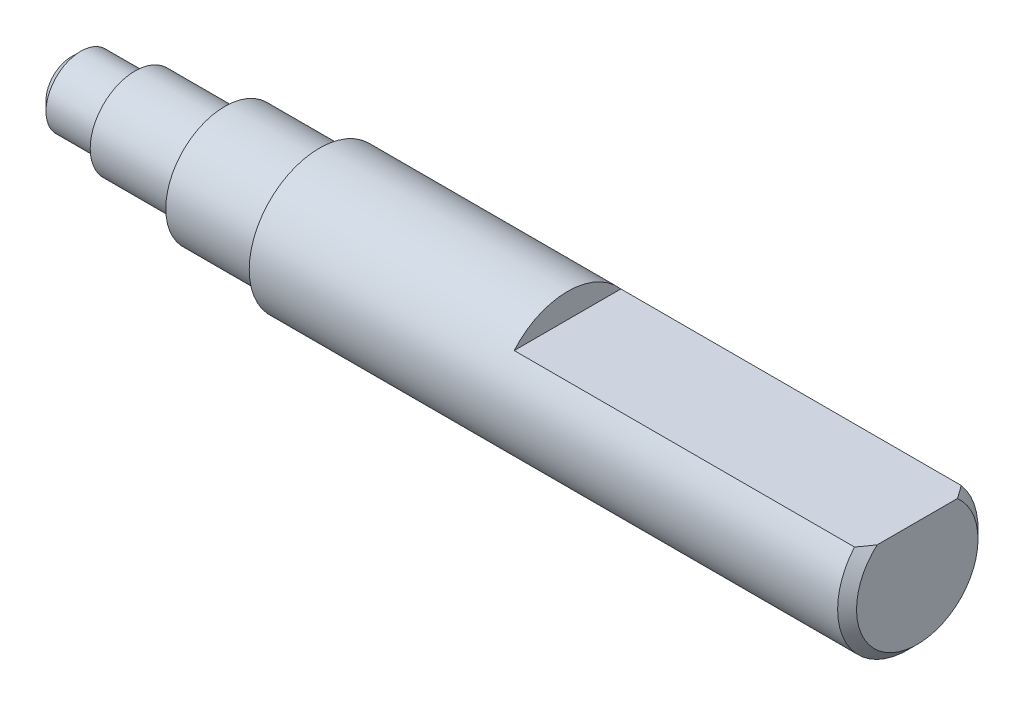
ISO-10303-21;
HEADER;
FILE_DESCRIPTION(('STEP AP214'),'2;1');
FILE_NAME('part.step','',(''),(''),'','','');
FILE_SCHEMA(('AUTOMOTIVE_DESIGN { 1 0 10303 214 1 1 1 1 }'));
ENDSEC;
DATA;
#1=APPLICATION_CONTEXT('core data for automotive mechanical design processes');
#2=APPLICATION_PROTOCOL_DEFINITION('international standard','automotive_design',2000,#1);
#3=PRODUCT_CONTEXT('',#1,'mechanical');
#4=PRODUCT('Part','Part','',(#3));
#5=PRODUCT_RELATED_PRODUCT_CATEGORY('part','',(#4));
#6=PRODUCT_DEFINITION_FORMATION('','',#4);
#7=PRODUCT_DEFINITION_CONTEXT('part definition',#1,'design');
#8=PRODUCT_DEFINITION('design','',#6,#7);
#9=PRODUCT_DEFINITION_SHAPE('','',#8);
#10=(LENGTH_UNIT() NAMED_UNIT(*) SI_UNIT(.MILLI.,.METRE.));
#11=(NAMED_UNIT(*) PLANE_ANGLE_UNIT() SI_UNIT($,.RADIAN.));
#12=(NAMED_UNIT(*) SI_UNIT($,.STERADIAN.) SOLID_ANGLE_UNIT());
#13=UNCERTAINTY_MEASURE_WITH_UNIT(LENGTH_MEASURE(1.E-05),#10,'distance_accuracy_value','');
#14=(GEOMETRIC_REPRESENTATION_CONTEXT(3) GLOBAL_UNCERTAINTY_ASSIGNED_CONTEXT((#13)) GLOBAL_UNIT_ASSIGNED_CONTEXT((#10,
#11,#12)) REPRESENTATION_CONTEXT('',''));
#15=CARTESIAN_POINT('',(0.,0.,0.));
#16=DIRECTION('',(0.,0.,1.));
#17=DIRECTION('',(1.,0.,0.));
#18=AXIS2_PLACEMENT_3D('',#15,#16,#17);
#19=CARTESIAN_POINT('',(0.,0.,0.));
#20=DIRECTION('',(1.,0.,0.));
#21=DIRECTION('',(0.,0.,-1.));
#22=AXIS2_PLACEMENT_3D('',#19,#20,#21);
#23=PLANE('',#22);
#24=CARTESIAN_POINT('',(0.,0.,0.));
#25=DIRECTION('',(1.,0.,0.));
#26=DIRECTION('',(0.,0.,-1.));
#27=AXIS2_PLACEMENT_3D('',#24,#25,#26);
#28=CIRCLE('',#27,0.535000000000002);
#29=CARTESIAN_POINT('',(0.,0.,-0.535000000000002));
#30=VERTEX_POINT('',#29);
#31=EDGE_CURVE('E126',#30,#30,#28,.F.);
#32=ORIENTED_EDGE('',*,*,#31,.T.);
#33=EDGE_LOOP('',(#32));
#34=FACE_BOUND('',#33,.T.);
#35=ADVANCED_FACE('F41',(#34),#23,.F.);
#36=CARTESIAN_POINT('',(-168.144085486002,0.,0.));
#37=DIRECTION('',(-1.,0.,0.));
#38=DIRECTION('',(0.,0.,1.));
#39=AXIS2_PLACEMENT_3D('',#36,#37,#38);
#40=CYLINDRICAL_SURFACE('',#39,0.735);
#41=CARTESIAN_POINT('',(0.200000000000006,0.,0.));
#42=DIRECTION('',(1.,0.,0.));
#43=DIRECTION('',(0.,0.,-1.));
#44=AXIS2_PLACEMENT_3D('',#41,#42,#43);
#45=CIRCLE('',#44,0.735);
#46=CARTESIAN_POINT('',(0.200000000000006,0.,-0.735));
#47=VERTEX_POINT('',#46);
#48=EDGE_CURVE('E130',#47,#47,#45,.T.);
#49=ORIENTED_EDGE('',*,*,#48,.T.);
#50=EDGE_LOOP('',(#49));
#51=FACE_BOUND('',#50,.T.);
#52=CARTESIAN_POINT('',(1.34999999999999,0.,0.));
#53=DIRECTION('',(-1.,0.,0.));
#54=DIRECTION('',(0.,0.,1.));
#55=AXIS2_PLACEMENT_3D('',#52,#53,#54);
#56=CIRCLE('',#55,0.735);
#57=CARTESIAN_POINT('',(1.34999999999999,0.,0.735));
#58=VERTEX_POINT('',#57);
#59=EDGE_CURVE('E122',#58,#58,#56,.T.);
#60=ORIENTED_EDGE('',*,*,#59,.T.);
#61=EDGE_LOOP('',(#60));
#62=FACE_BOUND('',#61,.T.);
#63=ADVANCED_FACE('F176',(#51,#62),#40,.T.);
#64=CARTESIAN_POINT('',(1.35,0.735,0.));
#65=DIRECTION('',(1.,0.,0.));
#66=DIRECTION('',(0.,0.,-1.));
#67=AXIS2_PLACEMENT_3D('',#64,#65,#66);
#68=PLANE('',#67);
#69=ORIENTED_EDGE('',*,*,#59,.F.);
#70=EDGE_LOOP('',(#69));
#71=FACE_BOUND('',#70,.T.);
#72=CARTESIAN_POINT('',(1.34999999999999,0.,0.));
#73=DIRECTION('',(-1.,0.,0.));
#74=DIRECTION('',(0.,0.,1.));
#75=AXIS2_PLACEMENT_3D('',#72,#73,#74);
#76=CIRCLE('',#75,0.95);
#77=CARTESIAN_POINT('',(1.34999999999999,0.,0.95));
#78=VERTEX_POINT('',#77);
#79=EDGE_CURVE('E118',#78,#78,#76,.T.);
#80=ORIENTED_EDGE('',*,*,#79,.T.);
#81=EDGE_LOOP('',(#80));
#82=FACE_BOUND('',#81,.T.);
#83=ADVANCED_FACE('F172',(#71,#82),#68,.F.);
#84=CARTESIAN_POINT('',(-168.144085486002,0.,0.));
#85=DIRECTION('',(-1.,0.,0.));
#86=DIRECTION('',(0.,0.,1.));
#87=AXIS2_PLACEMENT_3D('',#84,#85,#86);
#88=CYLINDRICAL_SURFACE('',#87,0.95);
#89=ORIENTED_EDGE('',*,*,#79,.F.);
#90=EDGE_LOOP('',(#89));
#91=FACE_BOUND('',#90,.T.);
#92=CARTESIAN_POINT('',(3.25,0.,0.));
#93=DIRECTION('',(-1.,0.,0.));
#94=DIRECTION('',(0.,0.,1.));
#95=AXIS2_PLACEMENT_3D('',#92,#93,#94);
#96=CIRCLE('',#95,0.95);
#97=CARTESIAN_POINT('',(3.25,0.,0.95));
#98=VERTEX_POINT('',#97);
#99=EDGE_CURVE('E114',#98,#98,#96,.T.);
#100=ORIENTED_EDGE('',*,*,#99,.T.);
#101=EDGE_LOOP('',(#100));
#102=FACE_BOUND('',#101,.T.);
#103=ADVANCED_FACE('F168',(#91,#102),#88,.T.);
#104=CARTESIAN_POINT('',(3.25,0.95,0.));
#105=DIRECTION('',(1.,0.,0.));
#106=DIRECTION('',(0.,0.,-1.));
#107=AXIS2_PLACEMENT_3D('',#104,#105,#106);
#108=PLANE('',#107);
#109=ORIENTED_EDGE('',*,*,#99,.F.);
#110=EDGE_LOOP('',(#109));
#111=FACE_BOUND('',#110,.T.);
#112=CARTESIAN_POINT('',(3.25,0.,0.));
#113=DIRECTION('',(-1.,0.,0.));
#114=DIRECTION('',(0.,0.,1.));
#115=AXIS2_PLACEMENT_3D('',#112,#113,#114);
#116=CIRCLE('',#115,1.25);
#117=CARTESIAN_POINT('',(3.25,0.,1.25));
#118=VERTEX_POINT('',#117);
#119=EDGE_CURVE('E110',#118,#118,#116,.T.);
#120=ORIENTED_EDGE('',*,*,#119,.T.);
#121=EDGE_LOOP('',(#120));
#122=FACE_BOUND('',#121,.T.);
#123=ADVANCED_FACE('F164',(#111,#122),#108,.F.);
#124=CARTESIAN_POINT('',(-168.144085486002,0.,0.));
#125=DIRECTION('',(-1.,0.,0.));
#126=DIRECTION('',(0.,0.,1.));
#127=AXIS2_PLACEMENT_3D('',#124,#125,#126);
#128=CYLINDRICAL_SURFACE('',#127,1.25);
#129=ORIENTED_EDGE('',*,*,#119,.F.);
#130=EDGE_LOOP('',(#129));
#131=FACE_BOUND('',#130,.T.);
#132=CARTESIAN_POINT('',(5.25,0.,0.));
#133=DIRECTION('',(-1.,0.,0.));
#134=DIRECTION('',(0.,0.,1.));
#135=AXIS2_PLACEMENT_3D('',#132,#133,#134);
#136=CIRCLE('',#135,1.25);
#137=CARTESIAN_POINT('',(5.25,0.,1.25));
#138=VERTEX_POINT('',#137);
#139=EDGE_CURVE('E106',#138,#138,#136,.T.);
#140=ORIENTED_EDGE('',*,*,#139,.T.);
#141=EDGE_LOOP('',(#140));
#142=FACE_BOUND('',#141,.T.);
#143=ADVANCED_FACE('F160',(#131,#142),#128,.T.);
#144=CARTESIAN_POINT('',(5.25,1.25,0.));
#145=DIRECTION('',(1.,0.,0.));
#146=DIRECTION('',(0.,0.,-1.));
#147=AXIS2_PLACEMENT_3D('',#144,#145,#146);
#148=PLANE('',#147);
#149=ORIENTED_EDGE('',*,*,#139,.F.);
#150=EDGE_LOOP('',(#149));
#151=FACE_BOUND('',#150,.T.);
#152=CARTESIAN_POINT('',(5.25,0.,0.));
#153=DIRECTION('',(-1.,0.,0.));
#154=DIRECTION('',(0.,0.,1.));
#155=AXIS2_PLACEMENT_3D('',#152,#153,#154);
#156=CIRCLE('',#155,1.485);
#157=CARTESIAN_POINT('',(5.25,0.,1.485));
#158=VERTEX_POINT('',#157);
#159=EDGE_CURVE('E99',#158,#158,#156,.T.);
#160=ORIENTED_EDGE('',*,*,#159,.T.);
#161=EDGE_LOOP('',(#160));
#162=FACE_BOUND('',#161,.T.);
#163=ADVANCED_FACE('F157',(#151,#162),#148,.F.);
#164=CARTESIAN_POINT('',(-168.144085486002,0.,0.));
#165=DIRECTION('',(-1.,0.,0.));
#166=DIRECTION('',(0.,0.,1.));
#167=AXIS2_PLACEMENT_3D('',#164,#165,#166);
#168=CYLINDRICAL_SURFACE('',#167,1.485);
#169=DIRECTION('',(1.,0.,0.));
#170=VECTOR('',#169,1.);
#171=CARTESIAN_POINT('',(10.5,0.965,-1.1287160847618));
#172=LINE('',#171,#170);
#173=CARTESIAN_POINT('',(10.5,0.965,-1.1287160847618));
#174=VERTEX_POINT('',#173);
#175=CARTESIAN_POINT('',(17.7,0.965,-1.1287160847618));
#176=VERTEX_POINT('',#175);
#177=EDGE_CURVE('E88',#174,#176,#172,.T.);
#178=ORIENTED_EDGE('',*,*,#177,.T.);
#179=CARTESIAN_POINT('',(17.7,0.,0.));
#180=DIRECTION('',(-1.,0.,0.));
#181=DIRECTION('',(0.,0.,1.));
#182=AXIS2_PLACEMENT_3D('',#179,#180,#181);
#183=CIRCLE('',#182,1.485);
#184=CARTESIAN_POINT('',(17.7,0.965,1.1287160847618));
#185=VERTEX_POINT('',#184);
#186=EDGE_CURVE('E95',#176,#185,#183,.T.);
#187=ORIENTED_EDGE('',*,*,#186,.T.);
#188=DIRECTION('',(1.,0.,0.));
#189=VECTOR('',#188,1.);
#190=CARTESIAN_POINT('',(10.5,0.965,1.1287160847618));
#191=LINE('',#190,#189);
#192=CARTESIAN_POINT('',(10.5,0.965,1.1287160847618));
#193=VERTEX_POINT('',#192);
#194=EDGE_CURVE('E87',#193,#185,#191,.T.);
#195=ORIENTED_EDGE('',*,*,#194,.F.);
#196=CARTESIAN_POINT('',(10.5,0.,0.));
#197=DIRECTION('',(1.,0.,0.));
#198=DIRECTION('',(0.,0.,-1.));
#199=AXIS2_PLACEMENT_3D('',#196,#197,#198);
#200=CIRCLE('',#199,1.485);
#201=EDGE_CURVE('E76',#174,#193,#200,.T.);
#202=ORIENTED_EDGE('',*,*,#201,.F.);
#203=EDGE_LOOP('',(#178,#187,#195,#202));
#204=FACE_BOUND('',#203,.T.);
#205=ORIENTED_EDGE('',*,*,#159,.F.);
#206=EDGE_LOOP('',(#205));
#207=FACE_BOUND('',#206,.T.);
#208=ADVANCED_FACE('F92',(#204,#207),#168,.T.);
#209=CARTESIAN_POINT('',(17.9,1.485,0.));
#210=DIRECTION('',(-1.,0.,0.));
#211=DIRECTION('',(0.,0.,1.));
#212=AXIS2_PLACEMENT_3D('',#209,#210,#211);
#213=PLANE('',#212);
#214=DIRECTION('',(0.,0.,-1.));
#215=VECTOR('',#214,1.);
#216=CARTESIAN_POINT('',(17.9,0.965,1.1287160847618));
#217=LINE('',#216,#215);
#218=CARTESIAN_POINT('',(17.9,0.965,0.848528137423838));
#219=VERTEX_POINT('',#218);
#220=CARTESIAN_POINT('',(17.9,0.965,-0.848528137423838));
#221=VERTEX_POINT('',#220);
#222=EDGE_CURVE('E84',#219,#221,#217,.T.);
#223=ORIENTED_EDGE('',*,*,#222,.F.);
#224=CARTESIAN_POINT('',(17.9,0.,0.));
#225=DIRECTION('',(-1.,0.,0.));
#226=DIRECTION('',(0.,0.,1.));
#227=AXIS2_PLACEMENT_3D('',#224,#225,#226);
#228=CIRCLE('',#227,1.28499999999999);
#229=EDGE_CURVE('E11',#219,#221,#228,.F.);
#230=ORIENTED_EDGE('',*,*,#229,.T.);
#231=EDGE_LOOP('',(#223,#230));
#232=FACE_BOUND('',#231,.T.);
#233=ADVANCED_FACE('F151',(#232),#213,.F.);
#234=CARTESIAN_POINT('',(10.5,0.965,1.1287160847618));
#235=DIRECTION('',(0.,-1.,0.));
#236=DIRECTION('',(0.,0.,-1.));
#237=AXIS2_PLACEMENT_3D('',#234,#235,#236);
#238=PLANE('',#237);
#239=ORIENTED_EDGE('',*,*,#194,.T.);
#240=CARTESIAN_POINT('',(17.7,0.965,1.1287160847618));
#241=CARTESIAN_POINT('',(17.7173626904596,0.965,1.10587021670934));
#242=CARTESIAN_POINT('',(17.7345872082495,0.965,1.08291835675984));
#243=CARTESIAN_POINT('',(17.7687043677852,0.965,1.03677907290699));
#244=CARTESIAN_POINT('',(17.7855970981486,0.965,1.01359171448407));
#245=CARTESIAN_POINT('',(17.819005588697,0.965,0.966944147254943));
#246=CARTESIAN_POINT('',(17.8355213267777,0.965,0.943483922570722));
#247=CARTESIAN_POINT('',(17.8681106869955,0.965,0.896249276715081));
#248=CARTESIAN_POINT('',(17.8841841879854,0.965,0.872474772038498));
#249=CARTESIAN_POINT('',(17.9,0.965,0.848528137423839));
#250=B_SPLINE_CURVE_WITH_KNOTS('',3,(#240,#241,#242,#243,#244,#245,#246,#247,#248,#249),
.UNSPECIFIED.,.F.,.F.,(4,2,2,2,4),(0.,0.0860852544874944,0.172147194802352,0.2582141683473,
0.344304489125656),.UNSPECIFIED.);
#251=EDGE_CURVE('E52',#185,#219,#250,.T.);
#252=ORIENTED_EDGE('',*,*,#251,.T.);
#253=ORIENTED_EDGE('',*,*,#222,.T.);
#254=CARTESIAN_POINT('',(17.9,0.965,-0.848528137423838));
#255=CARTESIAN_POINT('',(17.8841841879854,0.965,-0.872474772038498));
#256=CARTESIAN_POINT('',(17.8681106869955,0.965,-0.896249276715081));
#257=CARTESIAN_POINT('',(17.8355213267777,0.965,-0.943483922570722));
#258=CARTESIAN_POINT('',(17.819005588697,0.965,-0.966944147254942));
#259=CARTESIAN_POINT('',(17.7855970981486,0.965,-1.01359171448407));
#260=CARTESIAN_POINT('',(17.7687043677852,0.965,-1.03677907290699));
#261=CARTESIAN_POINT('',(17.7345872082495,0.965,-1.08291835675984));
#262=CARTESIAN_POINT('',(17.7173626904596,0.965,-1.10587021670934));
#263=CARTESIAN_POINT('',(17.7,0.965,-1.1287160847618));
#264=B_SPLINE_CURVE_WITH_KNOTS('',3,(#254,#255,#256,#257,#258,#259,#260,#261,#262,#263),
.UNSPECIFIED.,.F.,.F.,(4,2,2,2,4),(0.,0.0860903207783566,0.172157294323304,0.25821923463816,
0.344304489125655),.UNSPECIFIED.);
#265=EDGE_CURVE('E136',#221,#176,#264,.T.);
#266=ORIENTED_EDGE('',*,*,#265,.T.);
#267=ORIENTED_EDGE('',*,*,#177,.F.);
#268=DIRECTION('',(0.,0.,-1.));
#269=VECTOR('',#268,1.);
#270=CARTESIAN_POINT('',(10.5,0.965,1.1287160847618));
#271=LINE('',#270,#269);
#272=EDGE_CURVE('E79',#193,#174,#271,.T.);
#273=ORIENTED_EDGE('',*,*,#272,.F.);
#274=EDGE_LOOP('',(#239,#252,#253,#266,#267,#273));
#275=FACE_BOUND('',#274,.T.);
#276=ADVANCED_FACE('F86',(#275),#238,.F.);
#277=CARTESIAN_POINT('',(10.5,0.,0.));
#278=DIRECTION('',(1.,0.,0.));
#279=DIRECTION('',(0.,0.,-1.));
#280=AXIS2_PLACEMENT_3D('',#277,#278,#279);
#281=PLANE('',#280);
#282=ORIENTED_EDGE('',*,*,#201,.T.);
#283=ORIENTED_EDGE('',*,*,#272,.T.);
#284=EDGE_LOOP('',(#282,#283));
#285=FACE_BOUND('',#284,.T.);
#286=ADVANCED_FACE('F78',(#285),#281,.T.);
#287=CARTESIAN_POINT('',(0.,0.,0.));
#288=DIRECTION('',(1.,0.,0.));
#289=DIRECTION('',(0.,0.,-1.));
#290=AXIS2_PLACEMENT_3D('',#287,#288,#289);
#291=CONICAL_SURFACE('',#290,0.535000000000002,0.785398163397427);
#292=ORIENTED_EDGE('',*,*,#48,.F.);
#293=EDGE_LOOP('',(#292));
#294=FACE_BOUND('',#293,.T.);
#295=ORIENTED_EDGE('',*,*,#31,.F.);
#296=EDGE_LOOP('',(#295));
#297=FACE_BOUND('',#296,.T.);
#298=ADVANCED_FACE('F184',(#294,#297),#291,.T.);
#299=CARTESIAN_POINT('',(17.7,0.,0.));
#300=DIRECTION('',(-1.,0.,0.));
#301=DIRECTION('',(0.,0.,1.));
#302=AXIS2_PLACEMENT_3D('',#299,#300,#301);
#303=CONICAL_SURFACE('',#302,1.485,0.785398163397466);
#304=ORIENTED_EDGE('',*,*,#265,.F.);
#305=ORIENTED_EDGE('',*,*,#229,.F.);
#306=ORIENTED_EDGE('',*,*,#251,.F.);
#307=ORIENTED_EDGE('',*,*,#186,.F.);
#308=EDGE_LOOP('',(#304,#305,#306,#307));
#309=FACE_BOUND('',#308,.T.);
#310=ADVANCED_FACE('F44',(#309),#303,.T.);
#311=CLOSED_SHELL('',(#35,#63,#83,#103,#123,#143,#163,#208,#233,#276,#286,#298,#310));
#312=MANIFOLD_SOLID_BREP('B2',#311);
#313=ADVANCED_BREP_SHAPE_REPRESENTATION('',(#18,#312),#14);
#314=SHAPE_DEFINITION_REPRESENTATION(#9,#313);
ENDSEC;
END-ISO-10303-21;
